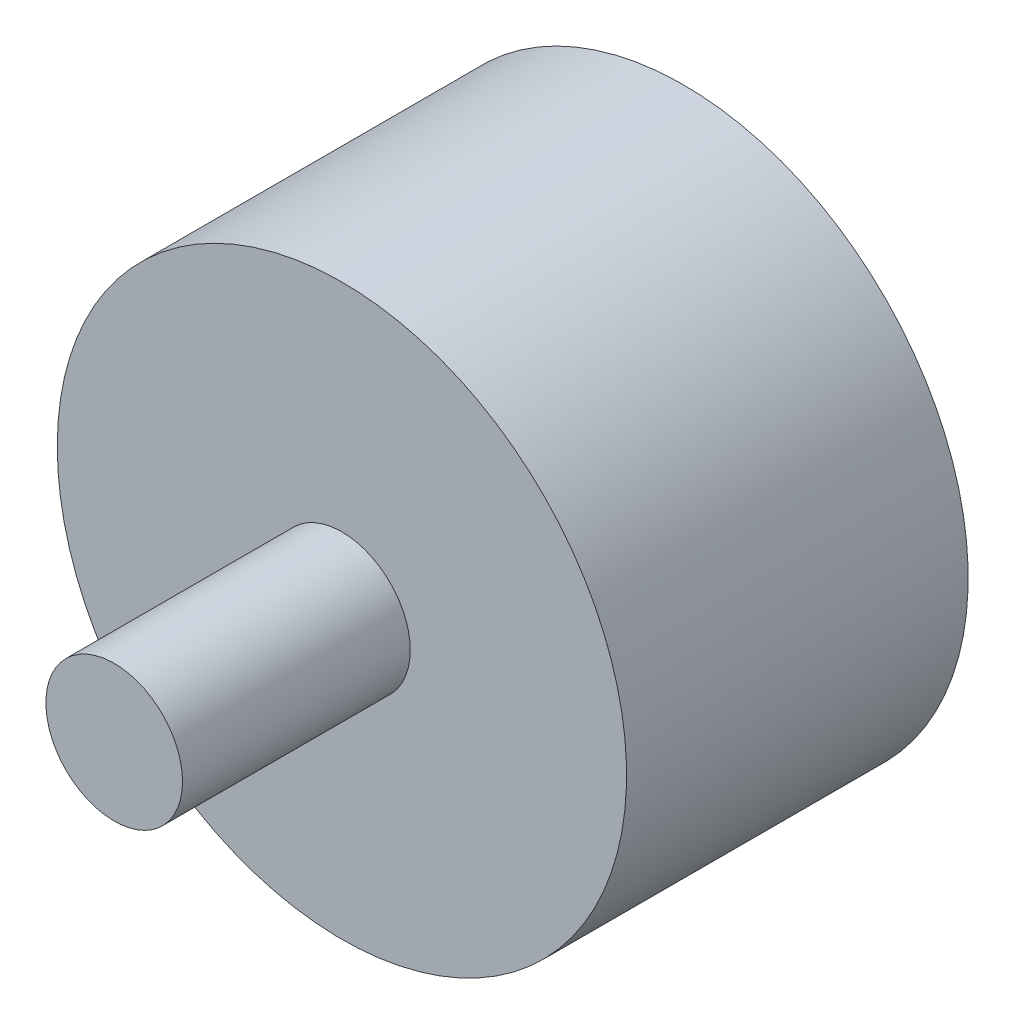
ISO-10303-21;
HEADER;
FILE_DESCRIPTION(('STEP AP214'),'2;1');
FILE_NAME('part.step','',(''),(''),'','','');
FILE_SCHEMA(('AUTOMOTIVE_DESIGN { 1 0 10303 214 1 1 1 1 }'));
ENDSEC;
DATA;
#1=APPLICATION_CONTEXT('core data for automotive mechanical design processes');
#2=APPLICATION_PROTOCOL_DEFINITION('international standard','automotive_design',2000,#1);
#3=PRODUCT_CONTEXT('',#1,'mechanical');
#4=PRODUCT('Part','Part','',(#3));
#5=PRODUCT_RELATED_PRODUCT_CATEGORY('part','',(#4));
#6=PRODUCT_DEFINITION_FORMATION('','',#4);
#7=PRODUCT_DEFINITION_CONTEXT('part definition',#1,'design');
#8=PRODUCT_DEFINITION('design','',#6,#7);
#9=PRODUCT_DEFINITION_SHAPE('','',#8);
#10=(LENGTH_UNIT() NAMED_UNIT(*) SI_UNIT(.MILLI.,.METRE.));
#11=(NAMED_UNIT(*) PLANE_ANGLE_UNIT() SI_UNIT($,.RADIAN.));
#12=(NAMED_UNIT(*) SI_UNIT($,.STERADIAN.) SOLID_ANGLE_UNIT());
#13=UNCERTAINTY_MEASURE_WITH_UNIT(LENGTH_MEASURE(1.E-05),#10,'distance_accuracy_value','');
#14=(GEOMETRIC_REPRESENTATION_CONTEXT(3) GLOBAL_UNCERTAINTY_ASSIGNED_CONTEXT((#13)) GLOBAL_UNIT_ASSIGNED_CONTEXT((#10,
#11,#12)) REPRESENTATION_CONTEXT('',''));
#15=CARTESIAN_POINT('',(0.,0.,0.));
#16=DIRECTION('',(0.,0.,1.));
#17=DIRECTION('',(1.,0.,0.));
#18=AXIS2_PLACEMENT_3D('',#15,#16,#17);
#19=CARTESIAN_POINT('',(0.,0.,10.));
#20=DIRECTION('',(0.,0.,-1.));
#21=DIRECTION('',(-1.,0.,0.));
#22=AXIS2_PLACEMENT_3D('',#19,#20,#21);
#23=PLANE('',#22);
#24=CARTESIAN_POINT('',(0.,0.,10.));
#25=DIRECTION('',(0.,0.,1.));
#26=DIRECTION('',(1.,0.,0.));
#27=AXIS2_PLACEMENT_3D('',#24,#25,#26);
#28=CIRCLE('',#27,3.);
#29=CARTESIAN_POINT('',(3.,0.,10.));
#30=VERTEX_POINT('',#29);
#31=EDGE_CURVE('E16',#30,#30,#28,.F.);
#32=ORIENTED_EDGE('',*,*,#31,.F.);
#33=EDGE_LOOP('',(#32));
#34=FACE_BOUND('',#33,.T.);
#35=ADVANCED_FACE('F13',(#34),#23,.F.);
#36=CARTESIAN_POINT('',(0.,0.,0.));
#37=DIRECTION('',(0.,0.,1.));
#38=DIRECTION('',(1.,0.,0.));
#39=AXIS2_PLACEMENT_3D('',#36,#37,#38);
#40=CYLINDRICAL_SURFACE('',#39,3.);
#41=CARTESIAN_POINT('',(0.,0.,0.));
#42=DIRECTION('',(0.,0.,1.));
#43=DIRECTION('',(1.,0.,0.));
#44=AXIS2_PLACEMENT_3D('',#41,#42,#43);
#45=CIRCLE('',#44,3.);
#46=CARTESIAN_POINT('',(3.,0.,0.));
#47=VERTEX_POINT('',#46);
#48=EDGE_CURVE('E25',#47,#47,#45,.T.);
#49=ORIENTED_EDGE('',*,*,#48,.T.);
#50=EDGE_LOOP('',(#49));
#51=FACE_BOUND('',#50,.T.);
#52=ORIENTED_EDGE('',*,*,#31,.T.);
#53=EDGE_LOOP('',(#52));
#54=FACE_BOUND('',#53,.T.);
#55=ADVANCED_FACE('F33',(#51,#54),#40,.T.);
#56=CARTESIAN_POINT('',(0.,0.,-15.));
#57=DIRECTION('',(0.,0.,-1.));
#58=DIRECTION('',(-1.,0.,0.));
#59=AXIS2_PLACEMENT_3D('',#56,#57,#58);
#60=PLANE('',#59);
#61=CARTESIAN_POINT('',(0.,0.,-15.));
#62=DIRECTION('',(0.,0.,-1.));
#63=DIRECTION('',(-1.,0.,0.));
#64=AXIS2_PLACEMENT_3D('',#61,#62,#63);
#65=CIRCLE('',#64,12.5);
#66=CARTESIAN_POINT('',(-12.5,0.,-15.));
#67=VERTEX_POINT('',#66);
#68=EDGE_CURVE('E20',#67,#67,#65,.F.);
#69=ORIENTED_EDGE('',*,*,#68,.F.);
#70=EDGE_LOOP('',(#69));
#71=FACE_BOUND('',#70,.T.);
#72=ADVANCED_FACE('F41',(#71),#60,.T.);
#73=CARTESIAN_POINT('',(0.,0.,0.));
#74=DIRECTION('',(0.,0.,-1.));
#75=DIRECTION('',(-1.,0.,0.));
#76=AXIS2_PLACEMENT_3D('',#73,#74,#75);
#77=PLANE('',#76);
#78=ORIENTED_EDGE('',*,*,#48,.F.);
#79=EDGE_LOOP('',(#78));
#80=FACE_BOUND('',#79,.T.);
#81=CARTESIAN_POINT('',(0.,0.,0.));
#82=DIRECTION('',(0.,0.,-1.));
#83=DIRECTION('',(-1.,0.,0.));
#84=AXIS2_PLACEMENT_3D('',#81,#82,#83);
#85=CIRCLE('',#84,12.5);
#86=CARTESIAN_POINT('',(-12.5,0.,0.));
#87=VERTEX_POINT('',#86);
#88=EDGE_CURVE('E9',#87,#87,#85,.T.);
#89=ORIENTED_EDGE('',*,*,#88,.F.);
#90=EDGE_LOOP('',(#89));
#91=FACE_BOUND('',#90,.T.);
#92=ADVANCED_FACE('F44',(#80,#91),#77,.F.);
#93=CARTESIAN_POINT('',(0.,0.,0.));
#94=DIRECTION('',(0.,0.,-1.));
#95=DIRECTION('',(-1.,0.,0.));
#96=AXIS2_PLACEMENT_3D('',#93,#94,#95);
#97=CYLINDRICAL_SURFACE('',#96,12.5);
#98=ORIENTED_EDGE('',*,*,#88,.T.);
#99=EDGE_LOOP('',(#98));
#100=FACE_BOUND('',#99,.T.);
#101=ORIENTED_EDGE('',*,*,#68,.T.);
#102=EDGE_LOOP('',(#101));
#103=FACE_BOUND('',#102,.T.);
#104=ADVANCED_FACE('F42',(#100,#103),#97,.T.);
#105=CLOSED_SHELL('',(#35,#55,#72,#92,#104));
#106=MANIFOLD_SOLID_BREP('B1',#105);
#107=ADVANCED_BREP_SHAPE_REPRESENTATION('',(#18,#106),#14);
#108=SHAPE_DEFINITION_REPRESENTATION(#9,#107);
ENDSEC;
END-ISO-10303-21;
